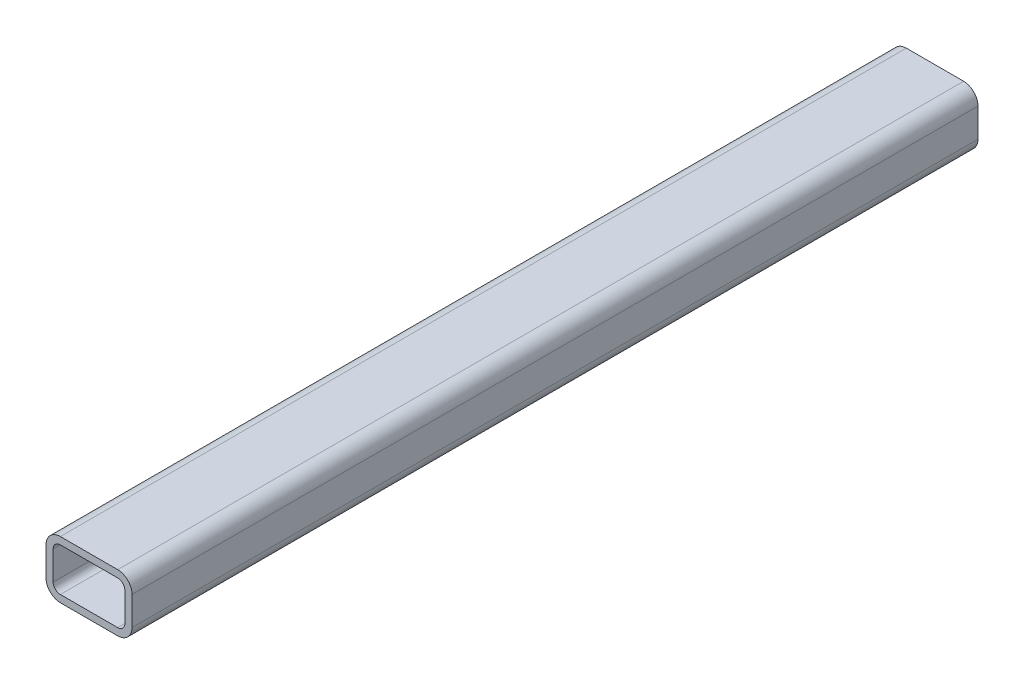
ISO-10303-21;
HEADER;
FILE_DESCRIPTION(('STEP AP214'),'2;1');
FILE_NAME('part.step','',(''),(''),'','','');
FILE_SCHEMA(('AUTOMOTIVE_DESIGN { 1 0 10303 214 1 1 1 1 }'));
ENDSEC;
DATA;
#1=APPLICATION_CONTEXT('core data for automotive mechanical design processes');
#2=APPLICATION_PROTOCOL_DEFINITION('international standard','automotive_design',2000,#1);
#3=PRODUCT_CONTEXT('',#1,'mechanical');
#4=PRODUCT('Part','Part','',(#3));
#5=PRODUCT_RELATED_PRODUCT_CATEGORY('part','',(#4));
#6=PRODUCT_DEFINITION_FORMATION('','',#4);
#7=PRODUCT_DEFINITION_CONTEXT('part definition',#1,'design');
#8=PRODUCT_DEFINITION('design','',#6,#7);
#9=PRODUCT_DEFINITION_SHAPE('','',#8);
#10=(LENGTH_UNIT() NAMED_UNIT(*) SI_UNIT(.MILLI.,.METRE.));
#11=(NAMED_UNIT(*) PLANE_ANGLE_UNIT() SI_UNIT($,.RADIAN.));
#12=(NAMED_UNIT(*) SI_UNIT($,.STERADIAN.) SOLID_ANGLE_UNIT());
#13=UNCERTAINTY_MEASURE_WITH_UNIT(LENGTH_MEASURE(1.E-05),#10,'distance_accuracy_value','');
#14=(GEOMETRIC_REPRESENTATION_CONTEXT(3) GLOBAL_UNCERTAINTY_ASSIGNED_CONTEXT((#13)) GLOBAL_UNIT_ASSIGNED_CONTEXT((#10,
#11,#12)) REPRESENTATION_CONTEXT('',''));
#15=CARTESIAN_POINT('',(0.,0.,0.));
#16=DIRECTION('',(0.,0.,1.));
#17=DIRECTION('',(1.,0.,0.));
#18=AXIS2_PLACEMENT_3D('',#15,#16,#17);
#19=CARTESIAN_POINT('',(-25.4,12.7,749.3));
#20=DIRECTION('',(0.,0.,-1.));
#21=DIRECTION('',(-1.,0.,0.));
#22=AXIS2_PLACEMENT_3D('',#19,#20,#21);
#23=CYLINDRICAL_SURFACE('',#22,12.7);
#24=CARTESIAN_POINT('',(-25.4,12.7,0.));
#25=DIRECTION('',(0.,0.,-1.));
#26=DIRECTION('',(-1.,0.,0.));
#27=AXIS2_PLACEMENT_3D('',#24,#25,#26);
#28=CIRCLE('',#27,12.7);
#29=CARTESIAN_POINT('',(-38.1,12.7,0.));
#30=VERTEX_POINT('',#29);
#31=CARTESIAN_POINT('',(-25.4,25.4,0.));
#32=VERTEX_POINT('',#31);
#33=EDGE_CURVE('E199',#30,#32,#28,.T.);
#34=ORIENTED_EDGE('',*,*,#33,.F.);
#35=DIRECTION('',(0.,0.,-1.));
#36=VECTOR('',#35,1.);
#37=CARTESIAN_POINT('',(-38.1,12.7,749.3));
#38=LINE('',#37,#36);
#39=CARTESIAN_POINT('',(-38.1,12.7,749.3));
#40=VERTEX_POINT('',#39);
#41=EDGE_CURVE('E11',#40,#30,#38,.T.);
#42=ORIENTED_EDGE('',*,*,#41,.F.);
#43=CARTESIAN_POINT('',(-25.4,12.7,749.3));
#44=DIRECTION('',(0.,0.,-1.));
#45=DIRECTION('',(-1.,0.,0.));
#46=AXIS2_PLACEMENT_3D('',#43,#44,#45);
#47=CIRCLE('',#46,12.7);
#48=CARTESIAN_POINT('',(-25.4,25.4,749.3));
#49=VERTEX_POINT('',#48);
#50=EDGE_CURVE('E211',#40,#49,#47,.T.);
#51=ORIENTED_EDGE('',*,*,#50,.T.);
#52=DIRECTION('',(0.,0.,-1.));
#53=VECTOR('',#52,1.);
#54=CARTESIAN_POINT('',(-25.4,25.4,749.3));
#55=LINE('',#54,#53);
#56=EDGE_CURVE('E35',#49,#32,#55,.T.);
#57=ORIENTED_EDGE('',*,*,#56,.T.);
#58=EDGE_LOOP('',(#34,#42,#51,#57));
#59=FACE_BOUND('',#58,.T.);
#60=ADVANCED_FACE('F32',(#59),#23,.T.);
#61=CARTESIAN_POINT('',(-38.1,12.7,749.3));
#62=DIRECTION('',(1.,0.,0.));
#63=DIRECTION('',(0.,0.,-1.));
#64=AXIS2_PLACEMENT_3D('',#61,#62,#63);
#65=PLANE('',#64);
#66=DIRECTION('',(0.,-1.,0.));
#67=VECTOR('',#66,1.);
#68=CARTESIAN_POINT('',(-38.1,12.7,0.));
#69=LINE('',#68,#67);
#70=CARTESIAN_POINT('',(-38.1,-12.7,0.));
#71=VERTEX_POINT('',#70);
#72=EDGE_CURVE('E215',#30,#71,#69,.T.);
#73=ORIENTED_EDGE('',*,*,#72,.T.);
#74=DIRECTION('',(0.,0.,-1.));
#75=VECTOR('',#74,1.);
#76=CARTESIAN_POINT('',(-38.1,-12.7,749.3));
#77=LINE('',#76,#75);
#78=CARTESIAN_POINT('',(-38.1,-12.7,749.3));
#79=VERTEX_POINT('',#78);
#80=EDGE_CURVE('E40',#79,#71,#77,.T.);
#81=ORIENTED_EDGE('',*,*,#80,.F.);
#82=DIRECTION('',(0.,-1.,0.));
#83=VECTOR('',#82,1.);
#84=CARTESIAN_POINT('',(-38.1,12.7,749.3));
#85=LINE('',#84,#83);
#86=EDGE_CURVE('E231',#40,#79,#85,.T.);
#87=ORIENTED_EDGE('',*,*,#86,.F.);
#88=ORIENTED_EDGE('',*,*,#41,.T.);
#89=EDGE_LOOP('',(#73,#81,#87,#88));
#90=FACE_BOUND('',#89,.T.);
#91=ADVANCED_FACE('F279',(#90),#65,.F.);
#92=CARTESIAN_POINT('',(-25.4,-12.7,749.3));
#93=DIRECTION('',(0.,0.,-1.));
#94=DIRECTION('',(-1.,0.,0.));
#95=AXIS2_PLACEMENT_3D('',#92,#93,#94);
#96=CYLINDRICAL_SURFACE('',#95,12.7);
#97=CARTESIAN_POINT('',(-25.4,-12.7,0.));
#98=DIRECTION('',(0.,0.,-1.));
#99=DIRECTION('',(-1.,0.,0.));
#100=AXIS2_PLACEMENT_3D('',#97,#98,#99);
#101=CIRCLE('',#100,12.7);
#102=CARTESIAN_POINT('',(-25.4,-25.4,0.));
#103=VERTEX_POINT('',#102);
#104=EDGE_CURVE('E249',#103,#71,#101,.T.);
#105=ORIENTED_EDGE('',*,*,#104,.F.);
#106=DIRECTION('',(0.,0.,-1.));
#107=VECTOR('',#106,1.);
#108=CARTESIAN_POINT('',(-25.4,-25.4,749.3));
#109=LINE('',#108,#107);
#110=CARTESIAN_POINT('',(-25.4,-25.4,749.3));
#111=VERTEX_POINT('',#110);
#112=EDGE_CURVE('E255',#111,#103,#109,.T.);
#113=ORIENTED_EDGE('',*,*,#112,.F.);
#114=CARTESIAN_POINT('',(-25.4,-12.7,749.3));
#115=DIRECTION('',(0.,0.,-1.));
#116=DIRECTION('',(-1.,0.,0.));
#117=AXIS2_PLACEMENT_3D('',#114,#115,#116);
#118=CIRCLE('',#117,12.7);
#119=EDGE_CURVE('E228',#111,#79,#118,.T.);
#120=ORIENTED_EDGE('',*,*,#119,.T.);
#121=ORIENTED_EDGE('',*,*,#80,.T.);
#122=EDGE_LOOP('',(#105,#113,#120,#121));
#123=FACE_BOUND('',#122,.T.);
#124=ADVANCED_FACE('F298',(#123),#96,.T.);
#125=CARTESIAN_POINT('',(25.4,-25.4,749.3));
#126=DIRECTION('',(0.,-1.,0.));
#127=DIRECTION('',(1.,0.,0.));
#128=AXIS2_PLACEMENT_3D('',#125,#126,#127);
#129=PLANE('',#128);
#130=DIRECTION('',(-1.,0.,0.));
#131=VECTOR('',#130,1.);
#132=CARTESIAN_POINT('',(25.4,-25.4,0.));
#133=LINE('',#132,#131);
#134=CARTESIAN_POINT('',(25.4,-25.4,0.));
#135=VERTEX_POINT('',#134);
#136=EDGE_CURVE('E246',#135,#103,#133,.T.);
#137=ORIENTED_EDGE('',*,*,#136,.F.);
#138=DIRECTION('',(0.,0.,-1.));
#139=VECTOR('',#138,1.);
#140=CARTESIAN_POINT('',(25.4,-25.4,749.3));
#141=LINE('',#140,#139);
#142=CARTESIAN_POINT('',(25.4,-25.4,749.3));
#143=VERTEX_POINT('',#142);
#144=EDGE_CURVE('E257',#143,#135,#141,.T.);
#145=ORIENTED_EDGE('',*,*,#144,.F.);
#146=DIRECTION('',(-1.,0.,0.));
#147=VECTOR('',#146,1.);
#148=CARTESIAN_POINT('',(25.4,-25.4,749.3));
#149=LINE('',#148,#147);
#150=EDGE_CURVE('E225',#143,#111,#149,.T.);
#151=ORIENTED_EDGE('',*,*,#150,.T.);
#152=ORIENTED_EDGE('',*,*,#112,.T.);
#153=EDGE_LOOP('',(#137,#145,#151,#152));
#154=FACE_BOUND('',#153,.T.);
#155=ADVANCED_FACE('F296',(#154),#129,.T.);
#156=CARTESIAN_POINT('',(25.4,-12.7,749.3));
#157=DIRECTION('',(0.,0.,-1.));
#158=DIRECTION('',(-1.,0.,0.));
#159=AXIS2_PLACEMENT_3D('',#156,#157,#158);
#160=CYLINDRICAL_SURFACE('',#159,12.7);
#161=CARTESIAN_POINT('',(25.4,-12.7,0.));
#162=DIRECTION('',(0.,0.,-1.));
#163=DIRECTION('',(-1.,0.,0.));
#164=AXIS2_PLACEMENT_3D('',#161,#162,#163);
#165=CIRCLE('',#164,12.7);
#166=CARTESIAN_POINT('',(38.1,-12.7,0.));
#167=VERTEX_POINT('',#166);
#168=EDGE_CURVE('E243',#167,#135,#165,.T.);
#169=ORIENTED_EDGE('',*,*,#168,.F.);
#170=DIRECTION('',(0.,0.,-1.));
#171=VECTOR('',#170,1.);
#172=CARTESIAN_POINT('',(38.1,-12.7,749.3));
#173=LINE('',#172,#171);
#174=CARTESIAN_POINT('',(38.1,-12.7,749.3));
#175=VERTEX_POINT('',#174);
#176=EDGE_CURVE('E259',#175,#167,#173,.T.);
#177=ORIENTED_EDGE('',*,*,#176,.F.);
#178=CARTESIAN_POINT('',(25.4,-12.7,749.3));
#179=DIRECTION('',(0.,0.,-1.));
#180=DIRECTION('',(-1.,0.,0.));
#181=AXIS2_PLACEMENT_3D('',#178,#179,#180);
#182=CIRCLE('',#181,12.7);
#183=EDGE_CURVE('E222',#175,#143,#182,.T.);
#184=ORIENTED_EDGE('',*,*,#183,.T.);
#185=ORIENTED_EDGE('',*,*,#144,.T.);
#186=EDGE_LOOP('',(#169,#177,#184,#185));
#187=FACE_BOUND('',#186,.T.);
#188=ADVANCED_FACE('F292',(#187),#160,.T.);
#189=CARTESIAN_POINT('',(38.1,-12.7,749.3));
#190=DIRECTION('',(-1.,0.,0.));
#191=DIRECTION('',(0.,0.,1.));
#192=AXIS2_PLACEMENT_3D('',#189,#190,#191);
#193=PLANE('',#192);
#194=DIRECTION('',(0.,1.,0.));
#195=VECTOR('',#194,1.);
#196=CARTESIAN_POINT('',(38.1,-12.7,0.));
#197=LINE('',#196,#195);
#198=CARTESIAN_POINT('',(38.1,12.7,0.));
#199=VERTEX_POINT('',#198);
#200=EDGE_CURVE('E241',#167,#199,#197,.T.);
#201=ORIENTED_EDGE('',*,*,#200,.T.);
#202=DIRECTION('',(0.,0.,-1.));
#203=VECTOR('',#202,1.);
#204=CARTESIAN_POINT('',(38.1,12.7,749.3));
#205=LINE('',#204,#203);
#206=CARTESIAN_POINT('',(38.1,12.7,749.3));
#207=VERTEX_POINT('',#206);
#208=EDGE_CURVE('E261',#207,#199,#205,.T.);
#209=ORIENTED_EDGE('',*,*,#208,.F.);
#210=DIRECTION('',(0.,1.,0.));
#211=VECTOR('',#210,1.);
#212=CARTESIAN_POINT('',(38.1,-12.7,749.3));
#213=LINE('',#212,#211);
#214=EDGE_CURVE('E220',#175,#207,#213,.T.);
#215=ORIENTED_EDGE('',*,*,#214,.F.);
#216=ORIENTED_EDGE('',*,*,#176,.T.);
#217=EDGE_LOOP('',(#201,#209,#215,#216));
#218=FACE_BOUND('',#217,.T.);
#219=ADVANCED_FACE('F333',(#218),#193,.F.);
#220=CARTESIAN_POINT('',(25.4,12.7,749.3));
#221=DIRECTION('',(0.,0.,-1.));
#222=DIRECTION('',(-1.,0.,0.));
#223=AXIS2_PLACEMENT_3D('',#220,#221,#222);
#224=CYLINDRICAL_SURFACE('',#223,12.7);
#225=CARTESIAN_POINT('',(25.4,12.7,0.));
#226=DIRECTION('',(0.,0.,1.));
#227=DIRECTION('',(1.,0.,0.));
#228=AXIS2_PLACEMENT_3D('',#225,#226,#227);
#229=CIRCLE('',#228,12.7);
#230=CARTESIAN_POINT('',(25.4,25.4,0.));
#231=VERTEX_POINT('',#230);
#232=EDGE_CURVE('E238',#199,#231,#229,.T.);
#233=ORIENTED_EDGE('',*,*,#232,.T.);
#234=DIRECTION('',(0.,0.,-1.));
#235=VECTOR('',#234,1.);
#236=CARTESIAN_POINT('',(25.4,25.4,749.3));
#237=LINE('',#236,#235);
#238=CARTESIAN_POINT('',(25.4,25.4,749.3));
#239=VERTEX_POINT('',#238);
#240=EDGE_CURVE('E263',#239,#231,#237,.T.);
#241=ORIENTED_EDGE('',*,*,#240,.F.);
#242=CARTESIAN_POINT('',(25.4,12.7,749.3));
#243=DIRECTION('',(0.,0.,1.));
#244=DIRECTION('',(1.,0.,0.));
#245=AXIS2_PLACEMENT_3D('',#242,#243,#244);
#246=CIRCLE('',#245,12.7);
#247=EDGE_CURVE('E218',#207,#239,#246,.T.);
#248=ORIENTED_EDGE('',*,*,#247,.F.);
#249=ORIENTED_EDGE('',*,*,#208,.T.);
#250=EDGE_LOOP('',(#233,#241,#248,#249));
#251=FACE_BOUND('',#250,.T.);
#252=ADVANCED_FACE('F287',(#251),#224,.T.);
#253=CARTESIAN_POINT('',(-25.4,25.4,749.3));
#254=DIRECTION('',(0.,1.,0.));
#255=DIRECTION('',(-1.,0.,0.));
#256=AXIS2_PLACEMENT_3D('',#253,#254,#255);
#257=PLANE('',#256);
#258=DIRECTION('',(1.,0.,0.));
#259=VECTOR('',#258,1.);
#260=CARTESIAN_POINT('',(-25.4,25.4,0.));
#261=LINE('',#260,#259);
#262=EDGE_CURVE('E235',#32,#231,#261,.T.);
#263=ORIENTED_EDGE('',*,*,#262,.F.);
#264=ORIENTED_EDGE('',*,*,#56,.F.);
#265=DIRECTION('',(1.,0.,0.));
#266=VECTOR('',#265,1.);
#267=CARTESIAN_POINT('',(-25.4,25.4,749.3));
#268=LINE('',#267,#266);
#269=EDGE_CURVE('E214',#49,#239,#268,.T.);
#270=ORIENTED_EDGE('',*,*,#269,.T.);
#271=ORIENTED_EDGE('',*,*,#240,.T.);
#272=EDGE_LOOP('',(#263,#264,#270,#271));
#273=FACE_BOUND('',#272,.T.);
#274=ADVANCED_FACE('F271',(#273),#257,.T.);
#275=CARTESIAN_POINT('',(-25.4,12.7,749.3));
#276=DIRECTION('',(0.,0.,-1.));
#277=DIRECTION('',(-1.,0.,0.));
#278=AXIS2_PLACEMENT_3D('',#275,#276,#277);
#279=PLANE('',#278);
#280=DIRECTION('',(0.,-1.,0.));
#281=VECTOR('',#280,1.);
#282=CARTESIAN_POINT('',(-31.75,12.7,749.3));
#283=LINE('',#282,#281);
#284=CARTESIAN_POINT('',(-31.75,12.7,749.3));
#285=VERTEX_POINT('',#284);
#286=CARTESIAN_POINT('',(-31.75,-12.7,749.3));
#287=VERTEX_POINT('',#286);
#288=EDGE_CURVE('E150',#285,#287,#283,.T.);
#289=ORIENTED_EDGE('',*,*,#288,.F.);
#290=CARTESIAN_POINT('',(-25.4,12.7,749.3));
#291=DIRECTION('',(0.,0.,-1.));
#292=DIRECTION('',(-1.,0.,0.));
#293=AXIS2_PLACEMENT_3D('',#290,#291,#292);
#294=CIRCLE('',#293,6.35000000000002);
#295=CARTESIAN_POINT('',(-25.4,19.05,749.3));
#296=VERTEX_POINT('',#295);
#297=EDGE_CURVE('E147',#285,#296,#294,.T.);
#298=ORIENTED_EDGE('',*,*,#297,.T.);
#299=DIRECTION('',(1.,0.,0.));
#300=VECTOR('',#299,1.);
#301=CARTESIAN_POINT('',(-25.4,19.05,749.3));
#302=LINE('',#301,#300);
#303=CARTESIAN_POINT('',(25.4,19.05,749.3));
#304=VERTEX_POINT('',#303);
#305=EDGE_CURVE('E153',#296,#304,#302,.T.);
#306=ORIENTED_EDGE('',*,*,#305,.T.);
#307=CARTESIAN_POINT('',(25.4,12.7,749.3));
#308=DIRECTION('',(0.,0.,-1.));
#309=DIRECTION('',(-1.,0.,0.));
#310=AXIS2_PLACEMENT_3D('',#307,#308,#309);
#311=CIRCLE('',#310,6.35000000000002);
#312=CARTESIAN_POINT('',(31.75,12.7,749.3));
#313=VERTEX_POINT('',#312);
#314=EDGE_CURVE('E157',#313,#304,#311,.F.);
#315=ORIENTED_EDGE('',*,*,#314,.F.);
#316=DIRECTION('',(0.,1.,0.));
#317=VECTOR('',#316,1.);
#318=CARTESIAN_POINT('',(31.75,12.7,749.3));
#319=LINE('',#318,#317);
#320=CARTESIAN_POINT('',(31.75,-12.7,749.3));
#321=VERTEX_POINT('',#320);
#322=EDGE_CURVE('E169',#321,#313,#319,.T.);
#323=ORIENTED_EDGE('',*,*,#322,.F.);
#324=CARTESIAN_POINT('',(25.4,-12.7,749.3));
#325=DIRECTION('',(0.,0.,-1.));
#326=DIRECTION('',(-1.,0.,0.));
#327=AXIS2_PLACEMENT_3D('',#324,#325,#326);
#328=CIRCLE('',#327,6.35000000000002);
#329=CARTESIAN_POINT('',(25.4,-19.05,749.3));
#330=VERTEX_POINT('',#329);
#331=EDGE_CURVE('E171',#321,#330,#328,.T.);
#332=ORIENTED_EDGE('',*,*,#331,.T.);
#333=DIRECTION('',(-1.,0.,0.));
#334=VECTOR('',#333,1.);
#335=CARTESIAN_POINT('',(-25.4,-19.05,749.3));
#336=LINE('',#335,#334);
#337=CARTESIAN_POINT('',(-25.4,-19.05,749.3));
#338=VERTEX_POINT('',#337);
#339=EDGE_CURVE('E174',#330,#338,#336,.T.);
#340=ORIENTED_EDGE('',*,*,#339,.T.);
#341=CARTESIAN_POINT('',(-25.4,-12.7,749.3));
#342=DIRECTION('',(0.,0.,-1.));
#343=DIRECTION('',(-1.,0.,0.));
#344=AXIS2_PLACEMENT_3D('',#341,#342,#343);
#345=CIRCLE('',#344,6.35000000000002);
#346=EDGE_CURVE('E177',#338,#287,#345,.T.);
#347=ORIENTED_EDGE('',*,*,#346,.T.);
#348=EDGE_LOOP('',(#289,#298,#306,#315,#323,#332,#340,#347));
#349=FACE_BOUND('',#348,.T.);
#350=ORIENTED_EDGE('',*,*,#50,.F.);
#351=ORIENTED_EDGE('',*,*,#86,.T.);
#352=ORIENTED_EDGE('',*,*,#119,.F.);
#353=ORIENTED_EDGE('',*,*,#150,.F.);
#354=ORIENTED_EDGE('',*,*,#183,.F.);
#355=ORIENTED_EDGE('',*,*,#214,.T.);
#356=ORIENTED_EDGE('',*,*,#247,.T.);
#357=ORIENTED_EDGE('',*,*,#269,.F.);
#358=EDGE_LOOP('',(#350,#351,#352,#353,#354,#355,#356,#357));
#359=FACE_BOUND('',#358,.T.);
#360=ADVANCED_FACE('F159',(#349,#359),#279,.F.);
#361=CARTESIAN_POINT('',(-25.4,12.7,0.));
#362=DIRECTION('',(0.,0.,-1.));
#363=DIRECTION('',(-1.,0.,0.));
#364=AXIS2_PLACEMENT_3D('',#361,#362,#363);
#365=PLANE('',#364);
#366=CARTESIAN_POINT('',(-25.4,12.7,0.));
#367=DIRECTION('',(0.,0.,-1.));
#368=DIRECTION('',(-1.,0.,0.));
#369=AXIS2_PLACEMENT_3D('',#366,#367,#368);
#370=CIRCLE('',#369,6.35000000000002);
#371=CARTESIAN_POINT('',(-31.75,12.7,0.));
#372=VERTEX_POINT('',#371);
#373=CARTESIAN_POINT('',(-25.4,19.05,0.));
#374=VERTEX_POINT('',#373);
#375=EDGE_CURVE('E56',#372,#374,#370,.T.);
#376=ORIENTED_EDGE('',*,*,#375,.F.);
#377=DIRECTION('',(0.,-1.,0.));
#378=VECTOR('',#377,1.);
#379=CARTESIAN_POINT('',(-31.75,12.7,0.));
#380=LINE('',#379,#378);
#381=CARTESIAN_POINT('',(-31.75,-12.7,0.));
#382=VERTEX_POINT('',#381);
#383=EDGE_CURVE('E162',#372,#382,#380,.T.);
#384=ORIENTED_EDGE('',*,*,#383,.T.);
#385=CARTESIAN_POINT('',(-25.4,-12.7,0.));
#386=DIRECTION('',(0.,0.,-1.));
#387=DIRECTION('',(-1.,0.,0.));
#388=AXIS2_PLACEMENT_3D('',#385,#386,#387);
#389=CIRCLE('',#388,6.35000000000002);
#390=CARTESIAN_POINT('',(-25.4,-19.05,0.));
#391=VERTEX_POINT('',#390);
#392=EDGE_CURVE('E165',#391,#382,#389,.T.);
#393=ORIENTED_EDGE('',*,*,#392,.F.);
#394=DIRECTION('',(-1.,0.,0.));
#395=VECTOR('',#394,1.);
#396=CARTESIAN_POINT('',(-25.4,-19.05,0.));
#397=LINE('',#396,#395);
#398=CARTESIAN_POINT('',(25.4,-19.05,0.));
#399=VERTEX_POINT('',#398);
#400=EDGE_CURVE('E192',#399,#391,#397,.T.);
#401=ORIENTED_EDGE('',*,*,#400,.F.);
#402=CARTESIAN_POINT('',(25.4,-12.7,0.));
#403=DIRECTION('',(0.,0.,-1.));
#404=DIRECTION('',(-1.,0.,0.));
#405=AXIS2_PLACEMENT_3D('',#402,#403,#404);
#406=CIRCLE('',#405,6.35000000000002);
#407=CARTESIAN_POINT('',(31.75,-12.7,0.));
#408=VERTEX_POINT('',#407);
#409=EDGE_CURVE('E189',#408,#399,#406,.T.);
#410=ORIENTED_EDGE('',*,*,#409,.F.);
#411=DIRECTION('',(0.,1.,0.));
#412=VECTOR('',#411,1.);
#413=CARTESIAN_POINT('',(31.75,12.7,0.));
#414=LINE('',#413,#412);
#415=CARTESIAN_POINT('',(31.75,12.7,0.));
#416=VERTEX_POINT('',#415);
#417=EDGE_CURVE('E186',#408,#416,#414,.T.);
#418=ORIENTED_EDGE('',*,*,#417,.T.);
#419=CARTESIAN_POINT('',(25.4,12.7,0.));
#420=DIRECTION('',(0.,0.,-1.));
#421=DIRECTION('',(-1.,0.,0.));
#422=AXIS2_PLACEMENT_3D('',#419,#420,#421);
#423=CIRCLE('',#422,6.35000000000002);
#424=CARTESIAN_POINT('',(25.4,19.05,0.));
#425=VERTEX_POINT('',#424);
#426=EDGE_CURVE('E183',#416,#425,#423,.F.);
#427=ORIENTED_EDGE('',*,*,#426,.T.);
#428=DIRECTION('',(1.,0.,0.));
#429=VECTOR('',#428,1.);
#430=CARTESIAN_POINT('',(-25.4,19.05,0.));
#431=LINE('',#430,#429);
#432=EDGE_CURVE('E181',#374,#425,#431,.T.);
#433=ORIENTED_EDGE('',*,*,#432,.F.);
#434=EDGE_LOOP('',(#376,#384,#393,#401,#410,#418,#427,#433));
#435=FACE_BOUND('',#434,.T.);
#436=ORIENTED_EDGE('',*,*,#33,.T.);
#437=ORIENTED_EDGE('',*,*,#262,.T.);
#438=ORIENTED_EDGE('',*,*,#232,.F.);
#439=ORIENTED_EDGE('',*,*,#200,.F.);
#440=ORIENTED_EDGE('',*,*,#168,.T.);
#441=ORIENTED_EDGE('',*,*,#136,.T.);
#442=ORIENTED_EDGE('',*,*,#104,.T.);
#443=ORIENTED_EDGE('',*,*,#72,.F.);
#444=EDGE_LOOP('',(#436,#437,#438,#439,#440,#441,#442,#443));
#445=FACE_BOUND('',#444,.T.);
#446=ADVANCED_FACE('F275',(#435,#445),#365,.T.);
#447=CARTESIAN_POINT('',(-25.4,12.7,749.3));
#448=DIRECTION('',(0.,0.,-1.));
#449=DIRECTION('',(-1.,0.,0.));
#450=AXIS2_PLACEMENT_3D('',#447,#448,#449);
#451=CYLINDRICAL_SURFACE('',#450,6.35000000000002);
#452=ORIENTED_EDGE('',*,*,#375,.T.);
#453=DIRECTION('',(0.,0.,-1.));
#454=VECTOR('',#453,1.);
#455=CARTESIAN_POINT('',(-25.4,19.05,749.3));
#456=LINE('',#455,#454);
#457=EDGE_CURVE('E144',#296,#374,#456,.T.);
#458=ORIENTED_EDGE('',*,*,#457,.F.);
#459=ORIENTED_EDGE('',*,*,#297,.F.);
#460=DIRECTION('',(0.,0.,-1.));
#461=VECTOR('',#460,1.);
#462=CARTESIAN_POINT('',(-31.75,12.7,749.3));
#463=LINE('',#462,#461);
#464=EDGE_CURVE('E197',#285,#372,#463,.T.);
#465=ORIENTED_EDGE('',*,*,#464,.T.);
#466=EDGE_LOOP('',(#452,#458,#459,#465));
#467=FACE_BOUND('',#466,.T.);
#468=ADVANCED_FACE('F145',(#467),#451,.F.);
#469=CARTESIAN_POINT('',(-31.75,12.7,749.3));
#470=DIRECTION('',(1.,0.,0.));
#471=DIRECTION('',(0.,0.,-1.));
#472=AXIS2_PLACEMENT_3D('',#469,#470,#471);
#473=PLANE('',#472);
#474=ORIENTED_EDGE('',*,*,#383,.F.);
#475=ORIENTED_EDGE('',*,*,#464,.F.);
#476=ORIENTED_EDGE('',*,*,#288,.T.);
#477=DIRECTION('',(0.,0.,-1.));
#478=VECTOR('',#477,1.);
#479=CARTESIAN_POINT('',(-31.75,-12.7,749.3));
#480=LINE('',#479,#478);
#481=EDGE_CURVE('E200',#287,#382,#480,.T.);
#482=ORIENTED_EDGE('',*,*,#481,.T.);
#483=EDGE_LOOP('',(#474,#475,#476,#482));
#484=FACE_BOUND('',#483,.T.);
#485=ADVANCED_FACE('F382',(#484),#473,.T.);
#486=CARTESIAN_POINT('',(-25.4,-12.7,749.3));
#487=DIRECTION('',(0.,0.,-1.));
#488=DIRECTION('',(-1.,0.,0.));
#489=AXIS2_PLACEMENT_3D('',#486,#487,#488);
#490=CYLINDRICAL_SURFACE('',#489,6.35000000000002);
#491=ORIENTED_EDGE('',*,*,#392,.T.);
#492=ORIENTED_EDGE('',*,*,#481,.F.);
#493=ORIENTED_EDGE('',*,*,#346,.F.);
#494=DIRECTION('',(0.,0.,-1.));
#495=VECTOR('',#494,1.);
#496=CARTESIAN_POINT('',(-25.4,-19.05,749.3));
#497=LINE('',#496,#495);
#498=EDGE_CURVE('E202',#338,#391,#497,.T.);
#499=ORIENTED_EDGE('',*,*,#498,.T.);
#500=EDGE_LOOP('',(#491,#492,#493,#499));
#501=FACE_BOUND('',#500,.T.);
#502=ADVANCED_FACE('F391',(#501),#490,.F.);
#503=CARTESIAN_POINT('',(-25.4,-19.05,749.3));
#504=DIRECTION('',(0.,-1.,0.));
#505=DIRECTION('',(1.,0.,0.));
#506=AXIS2_PLACEMENT_3D('',#503,#504,#505);
#507=PLANE('',#506);
#508=ORIENTED_EDGE('',*,*,#400,.T.);
#509=ORIENTED_EDGE('',*,*,#498,.F.);
#510=ORIENTED_EDGE('',*,*,#339,.F.);
#511=DIRECTION('',(0.,0.,-1.));
#512=VECTOR('',#511,1.);
#513=CARTESIAN_POINT('',(25.4,-19.05,749.3));
#514=LINE('',#513,#512);
#515=EDGE_CURVE('E204',#330,#399,#514,.T.);
#516=ORIENTED_EDGE('',*,*,#515,.T.);
#517=EDGE_LOOP('',(#508,#509,#510,#516));
#518=FACE_BOUND('',#517,.T.);
#519=ADVANCED_FACE('F401',(#518),#507,.F.);
#520=CARTESIAN_POINT('',(25.4,-12.7,749.3));
#521=DIRECTION('',(0.,0.,-1.));
#522=DIRECTION('',(-1.,0.,0.));
#523=AXIS2_PLACEMENT_3D('',#520,#521,#522);
#524=CYLINDRICAL_SURFACE('',#523,6.35000000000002);
#525=ORIENTED_EDGE('',*,*,#409,.T.);
#526=ORIENTED_EDGE('',*,*,#515,.F.);
#527=ORIENTED_EDGE('',*,*,#331,.F.);
#528=DIRECTION('',(0.,0.,-1.));
#529=VECTOR('',#528,1.);
#530=CARTESIAN_POINT('',(31.75,-12.7,749.3));
#531=LINE('',#530,#529);
#532=EDGE_CURVE('E206',#321,#408,#531,.T.);
#533=ORIENTED_EDGE('',*,*,#532,.T.);
#534=EDGE_LOOP('',(#525,#526,#527,#533));
#535=FACE_BOUND('',#534,.T.);
#536=ADVANCED_FACE('F411',(#535),#524,.F.);
#537=CARTESIAN_POINT('',(31.75,12.7,749.3));
#538=DIRECTION('',(-1.,0.,0.));
#539=DIRECTION('',(0.,0.,1.));
#540=AXIS2_PLACEMENT_3D('',#537,#538,#539);
#541=PLANE('',#540);
#542=ORIENTED_EDGE('',*,*,#417,.F.);
#543=ORIENTED_EDGE('',*,*,#532,.F.);
#544=ORIENTED_EDGE('',*,*,#322,.T.);
#545=DIRECTION('',(0.,0.,-1.));
#546=VECTOR('',#545,1.);
#547=CARTESIAN_POINT('',(31.75,12.7,749.3));
#548=LINE('',#547,#546);
#549=EDGE_CURVE('E208',#313,#416,#548,.T.);
#550=ORIENTED_EDGE('',*,*,#549,.T.);
#551=EDGE_LOOP('',(#542,#543,#544,#550));
#552=FACE_BOUND('',#551,.T.);
#553=ADVANCED_FACE('F421',(#552),#541,.T.);
#554=CARTESIAN_POINT('',(25.4,12.7,749.3));
#555=DIRECTION('',(0.,0.,-1.));
#556=DIRECTION('',(-1.,0.,0.));
#557=AXIS2_PLACEMENT_3D('',#554,#555,#556);
#558=CYLINDRICAL_SURFACE('',#557,6.35000000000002);
#559=ORIENTED_EDGE('',*,*,#426,.F.);
#560=ORIENTED_EDGE('',*,*,#549,.F.);
#561=ORIENTED_EDGE('',*,*,#314,.T.);
#562=DIRECTION('',(0.,0.,-1.));
#563=VECTOR('',#562,1.);
#564=CARTESIAN_POINT('',(25.4,19.05,749.3));
#565=LINE('',#564,#563);
#566=EDGE_CURVE('E48',#304,#425,#565,.T.);
#567=ORIENTED_EDGE('',*,*,#566,.T.);
#568=EDGE_LOOP('',(#559,#560,#561,#567));
#569=FACE_BOUND('',#568,.T.);
#570=ADVANCED_FACE('F431',(#569),#558,.F.);
#571=CARTESIAN_POINT('',(-25.4,19.05,749.3));
#572=DIRECTION('',(0.,1.,0.));
#573=DIRECTION('',(-1.,0.,0.));
#574=AXIS2_PLACEMENT_3D('',#571,#572,#573);
#575=PLANE('',#574);
#576=ORIENTED_EDGE('',*,*,#432,.T.);
#577=ORIENTED_EDGE('',*,*,#566,.F.);
#578=ORIENTED_EDGE('',*,*,#305,.F.);
#579=ORIENTED_EDGE('',*,*,#457,.T.);
#580=EDGE_LOOP('',(#576,#577,#578,#579));
#581=FACE_BOUND('',#580,.T.);
#582=ADVANCED_FACE('F154',(#581),#575,.F.);
#583=CLOSED_SHELL('',(#60,#91,#124,#155,#188,#219,#252,#274,#360,#446,#468,#485,#502,#519,#536,
#553,#570,#582));
#584=MANIFOLD_SOLID_BREP('B2',#583);
#585=ADVANCED_BREP_SHAPE_REPRESENTATION('',(#18,#584),#14);
#586=SHAPE_DEFINITION_REPRESENTATION(#9,#585);
ENDSEC;
END-ISO-10303-21;
